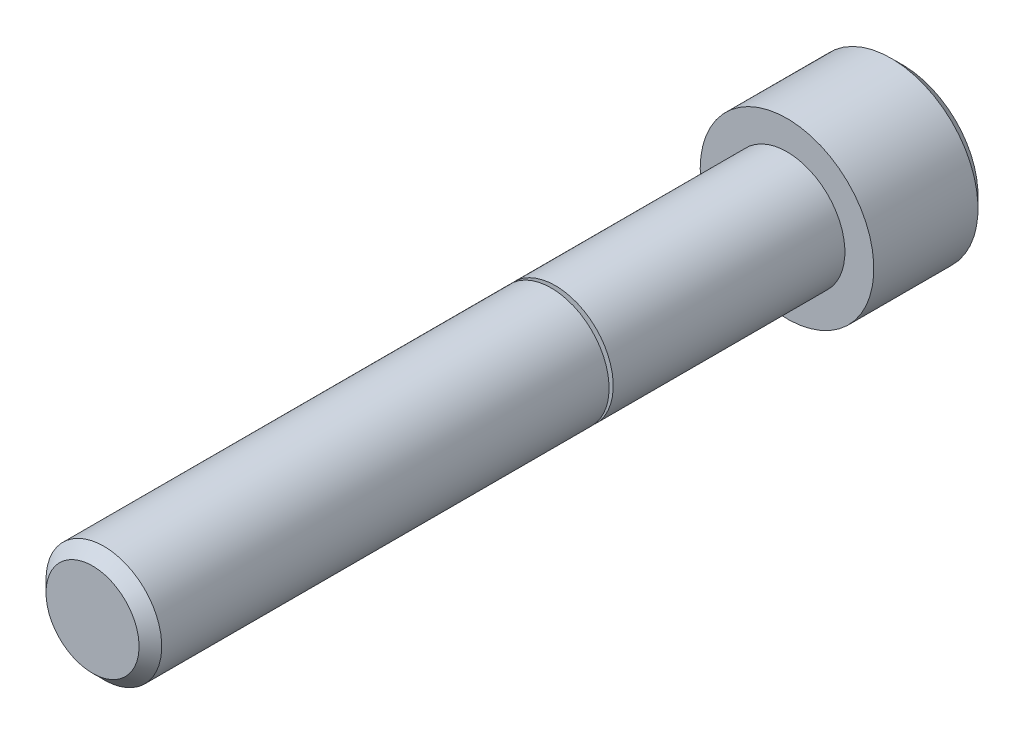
from build123d import *

# Parameters (mm, degrees)
CUT_EXTRUDE1_DEPTH = 3.175


with BuildPart() as part:
    # Logo3_bib1 → Revolve1 (revolve)
    with BuildSketch(Plane(origin=(0, 0, 0), x_dir=(-1, 0, 0), z_dir=(0, -1, 0))):
        with BuildLine():
            Line((0, -38.1), (0, 6.35))
            Line((0, 6.35), (4.1275, 6.35))
            Line((4.1275, 6.35), (4.7625, 5.715))
            Line((4.7625, 5.715), (4.7625, 0))
            Line((4.7625, 0), (3.175, 0))
            Line((3.175, 0), (3.175, -12.71))
            Line((3.175, -12.71), (2.666125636, -12.71))
            ThreePointArc((2.666125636, -12.71), (2.646429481, -12.726527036), (2.659285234, -12.748793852))
            Line((2.659285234, -12.748793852), (3.175, -12.936498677))
            Line((3.175, -12.936498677), (3.175, -37.4777))
            Line((3.175, -37.4777), (2.5527, -38.1))
            Line((2.5527, -38.1), (0, -38.1))
        make_face()
    revolve(axis=Axis((0, 0, -10.585154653), (0, 0, 1)))

    # Logo3_bib2 → Cut-Extrude1 (cut)
    with BuildSketch(Plane(origin=(0, 0, -6.35), x_dir=(1, 0, 0), z_dir=(0, 0, -1))):
        Polygon((2.749630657, 0), (1.374815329, 2.38125), (-1.374815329, 2.38125), (-2.749630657, 0), (-1.374815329, -2.38125), (1.374815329, -2.38125), align=None)
    extrude(amount=-CUT_EXTRUDE1_DEPTH, mode=Mode.SUBTRACT)


solid = part.part
